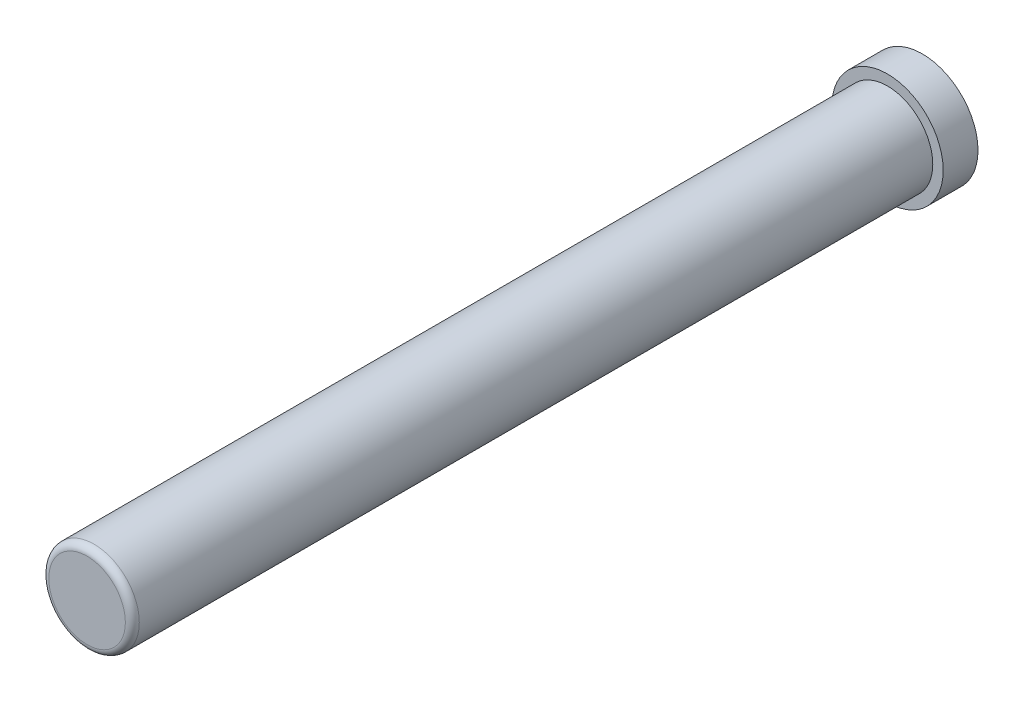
from build123d import *

# Parameters (mm, degrees)
SKETCH_1_R      = 8
EXTRUDE_1_DEPTH = 5
SKETCH_2_R      = 6.5
EXTRUDE_2_DEPTH = 115
FILLET_1_R      = 1


with BuildPart() as part:
    # Sketch 1 → Extrude 1 (new body)
    with BuildSketch(Plane.XY):
        Circle(SKETCH_1_R)
    extrude(amount=EXTRUDE_1_DEPTH)

    # Sketch 2 → Extrude 2 (add)
    with BuildSketch(Plane.XY.offset(5)):
        Circle(SKETCH_2_R)
    extrude(amount=EXTRUDE_2_DEPTH)

    # Fillet 1
    fillet_1_edges = [part.edges().sort_by_distance(p)[0] for p in [
        (-6.5, 0, 120),
    ]]
    fillet(fillet_1_edges, radius=FILLET_1_R)


solid = part.part
